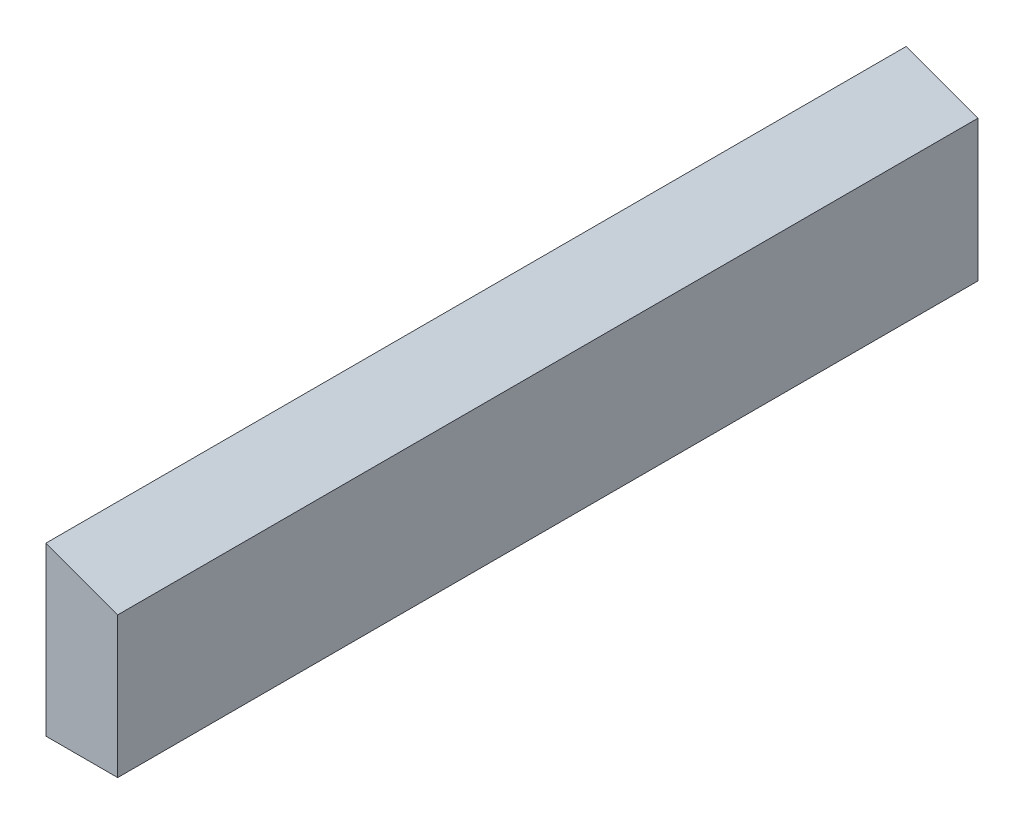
ISO-10303-21;
HEADER;
FILE_DESCRIPTION(('STEP AP214'),'2;1');
FILE_NAME('part.step','',(''),(''),'','','');
FILE_SCHEMA(('AUTOMOTIVE_DESIGN { 1 0 10303 214 1 1 1 1 }'));
ENDSEC;
DATA;
#1=APPLICATION_CONTEXT('core data for automotive mechanical design processes');
#2=APPLICATION_PROTOCOL_DEFINITION('international standard','automotive_design',2000,#1);
#3=PRODUCT_CONTEXT('',#1,'mechanical');
#4=PRODUCT('Part','Part','',(#3));
#5=PRODUCT_RELATED_PRODUCT_CATEGORY('part','',(#4));
#6=PRODUCT_DEFINITION_FORMATION('','',#4);
#7=PRODUCT_DEFINITION_CONTEXT('part definition',#1,'design');
#8=PRODUCT_DEFINITION('design','',#6,#7);
#9=PRODUCT_DEFINITION_SHAPE('','',#8);
#10=(LENGTH_UNIT() NAMED_UNIT(*) SI_UNIT(.MILLI.,.METRE.));
#11=(NAMED_UNIT(*) PLANE_ANGLE_UNIT() SI_UNIT($,.RADIAN.));
#12=(NAMED_UNIT(*) SI_UNIT($,.STERADIAN.) SOLID_ANGLE_UNIT());
#13=UNCERTAINTY_MEASURE_WITH_UNIT(LENGTH_MEASURE(1.E-05),#10,'distance_accuracy_value','');
#14=(GEOMETRIC_REPRESENTATION_CONTEXT(3) GLOBAL_UNCERTAINTY_ASSIGNED_CONTEXT((#13)) GLOBAL_UNIT_ASSIGNED_CONTEXT((#10,
#11,#12)) REPRESENTATION_CONTEXT('',''));
#15=CARTESIAN_POINT('',(0.,0.,0.));
#16=DIRECTION('',(0.,0.,1.));
#17=DIRECTION('',(1.,0.,0.));
#18=AXIS2_PLACEMENT_3D('',#15,#16,#17);
#19=CARTESIAN_POINT('',(-19.05,-44.45,-457.2));
#20=DIRECTION('',(1.,0.,0.));
#21=DIRECTION('',(0.,0.,-1.));
#22=AXIS2_PLACEMENT_3D('',#19,#20,#21);
#23=PLANE('',#22);
#24=DIRECTION('',(0.,1.,0.));
#25=VECTOR('',#24,1.);
#26=CARTESIAN_POINT('',(-19.05,-44.45,0.));
#27=LINE('',#26,#25);
#28=CARTESIAN_POINT('',(-19.05,-44.45,0.));
#29=VERTEX_POINT('',#28);
#30=CARTESIAN_POINT('',(-19.05,44.45,0.));
#31=VERTEX_POINT('',#30);
#32=EDGE_CURVE('E63',#29,#31,#27,.T.);
#33=ORIENTED_EDGE('',*,*,#32,.T.);
#34=DIRECTION('',(0.,0.,1.));
#35=VECTOR('',#34,1.);
#36=CARTESIAN_POINT('',(-19.05,44.45,-457.2));
#37=LINE('',#36,#35);
#38=CARTESIAN_POINT('',(-19.05,44.45,-457.2));
#39=VERTEX_POINT('',#38);
#40=EDGE_CURVE('E11',#39,#31,#37,.T.);
#41=ORIENTED_EDGE('',*,*,#40,.F.);
#42=DIRECTION('',(0.,1.,0.));
#43=VECTOR('',#42,1.);
#44=CARTESIAN_POINT('',(-19.05,-44.45,-457.2));
#45=LINE('',#44,#43);
#46=CARTESIAN_POINT('',(-19.05,-44.45,-457.2));
#47=VERTEX_POINT('',#46);
#48=EDGE_CURVE('E65',#47,#39,#45,.T.);
#49=ORIENTED_EDGE('',*,*,#48,.F.);
#50=DIRECTION('',(0.,0.,1.));
#51=VECTOR('',#50,1.);
#52=CARTESIAN_POINT('',(-19.05,-44.45,-457.2));
#53=LINE('',#52,#51);
#54=EDGE_CURVE('E48',#47,#29,#53,.T.);
#55=ORIENTED_EDGE('',*,*,#54,.T.);
#56=EDGE_LOOP('',(#33,#41,#49,#55));
#57=FACE_BOUND('',#56,.T.);
#58=ADVANCED_FACE('F32',(#57),#23,.F.);
#59=CARTESIAN_POINT('',(19.05,-44.45,-457.2));
#60=DIRECTION('',(1.,0.,0.));
#61=DIRECTION('',(0.,0.,-1.));
#62=AXIS2_PLACEMENT_3D('',#59,#60,#61);
#63=PLANE('',#62);
#64=DIRECTION('',(0.,0.,1.));
#65=VECTOR('',#64,1.);
#66=CARTESIAN_POINT('',(19.05,30.4508011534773,-457.2));
#67=LINE('',#66,#65);
#68=CARTESIAN_POINT('',(19.05,30.4508011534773,-457.2));
#69=VERTEX_POINT('',#68);
#70=CARTESIAN_POINT('',(19.05,30.4508011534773,0.));
#71=VERTEX_POINT('',#70);
#72=EDGE_CURVE('E78',#69,#71,#67,.T.);
#73=ORIENTED_EDGE('',*,*,#72,.T.);
#74=DIRECTION('',(0.,1.,0.));
#75=VECTOR('',#74,1.);
#76=CARTESIAN_POINT('',(19.05,-44.45,0.));
#77=LINE('',#76,#75);
#78=CARTESIAN_POINT('',(19.05,-44.45,0.));
#79=VERTEX_POINT('',#78);
#80=EDGE_CURVE('E77',#79,#71,#77,.T.);
#81=ORIENTED_EDGE('',*,*,#80,.F.);
#82=DIRECTION('',(0.,0.,1.));
#83=VECTOR('',#82,1.);
#84=CARTESIAN_POINT('',(19.05,-44.45,-457.2));
#85=LINE('',#84,#83);
#86=CARTESIAN_POINT('',(19.05,-44.45,-457.2));
#87=VERTEX_POINT('',#86);
#88=EDGE_CURVE('E40',#87,#79,#85,.T.);
#89=ORIENTED_EDGE('',*,*,#88,.F.);
#90=DIRECTION('',(0.,1.,0.));
#91=VECTOR('',#90,1.);
#92=CARTESIAN_POINT('',(19.05,-44.45,-457.2));
#93=LINE('',#92,#91);
#94=EDGE_CURVE('E82',#87,#69,#93,.T.);
#95=ORIENTED_EDGE('',*,*,#94,.T.);
#96=EDGE_LOOP('',(#73,#81,#89,#95));
#97=FACE_BOUND('',#96,.T.);
#98=ADVANCED_FACE('F103',(#97),#63,.T.);
#99=CARTESIAN_POINT('',(-19.05,-44.45,-457.2));
#100=DIRECTION('',(0.,-1.,0.));
#101=DIRECTION('',(0.,0.,-1.));
#102=AXIS2_PLACEMENT_3D('',#99,#100,#101);
#103=PLANE('',#102);
#104=DIRECTION('',(1.,0.,0.));
#105=VECTOR('',#104,1.);
#106=CARTESIAN_POINT('',(-19.05,-44.45,0.));
#107=LINE('',#106,#105);
#108=EDGE_CURVE('E74',#29,#79,#107,.T.);
#109=ORIENTED_EDGE('',*,*,#108,.F.);
#110=ORIENTED_EDGE('',*,*,#54,.F.);
#111=DIRECTION('',(1.,0.,0.));
#112=VECTOR('',#111,1.);
#113=CARTESIAN_POINT('',(-19.05,-44.45,-457.2));
#114=LINE('',#113,#112);
#115=EDGE_CURVE('E67',#47,#87,#114,.T.);
#116=ORIENTED_EDGE('',*,*,#115,.T.);
#117=ORIENTED_EDGE('',*,*,#88,.T.);
#118=EDGE_LOOP('',(#109,#110,#116,#117));
#119=FACE_BOUND('',#118,.T.);
#120=ADVANCED_FACE('F80',(#119),#103,.T.);
#121=CARTESIAN_POINT('',(0.,0.,-457.2));
#122=DIRECTION('',(0.,0.,-1.));
#123=DIRECTION('',(-1.,0.,0.));
#124=AXIS2_PLACEMENT_3D('',#121,#122,#123);
#125=PLANE('',#124);
#126=DIRECTION('',(0.938643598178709,-0.344888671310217,0.));
#127=VECTOR('',#126,1.);
#128=CARTESIAN_POINT('',(-19.05,44.45,-457.2));
#129=LINE('',#128,#127);
#130=EDGE_CURVE('E91',#39,#69,#129,.T.);
#131=ORIENTED_EDGE('',*,*,#130,.T.);
#132=ORIENTED_EDGE('',*,*,#94,.F.);
#133=ORIENTED_EDGE('',*,*,#115,.F.);
#134=ORIENTED_EDGE('',*,*,#48,.T.);
#135=EDGE_LOOP('',(#131,#132,#133,#134));
#136=FACE_BOUND('',#135,.T.);
#137=ADVANCED_FACE('F97',(#136),#125,.T.);
#138=CARTESIAN_POINT('',(0.,0.,0.));
#139=DIRECTION('',(0.,0.,-1.));
#140=DIRECTION('',(-1.,0.,0.));
#141=AXIS2_PLACEMENT_3D('',#138,#139,#140);
#142=PLANE('',#141);
#143=ORIENTED_EDGE('',*,*,#80,.T.);
#144=DIRECTION('',(0.938643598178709,-0.344888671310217,0.));
#145=VECTOR('',#144,1.);
#146=CARTESIAN_POINT('',(-19.05,44.45,0.));
#147=LINE('',#146,#145);
#148=EDGE_CURVE('E76',#31,#71,#147,.T.);
#149=ORIENTED_EDGE('',*,*,#148,.F.);
#150=ORIENTED_EDGE('',*,*,#32,.F.);
#151=ORIENTED_EDGE('',*,*,#108,.T.);
#152=EDGE_LOOP('',(#143,#149,#150,#151));
#153=FACE_BOUND('',#152,.T.);
#154=ADVANCED_FACE('F73',(#153),#142,.F.);
#155=CARTESIAN_POINT('',(-19.05,44.45,-457.2));
#156=DIRECTION('',(-0.344888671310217,-0.938643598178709,0.));
#157=DIRECTION('',(0.938643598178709,-0.344888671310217,0.));
#158=AXIS2_PLACEMENT_3D('',#155,#156,#157);
#159=PLANE('',#158);
#160=ORIENTED_EDGE('',*,*,#148,.T.);
#161=ORIENTED_EDGE('',*,*,#72,.F.);
#162=ORIENTED_EDGE('',*,*,#130,.F.);
#163=ORIENTED_EDGE('',*,*,#40,.T.);
#164=EDGE_LOOP('',(#160,#161,#162,#163));
#165=FACE_BOUND('',#164,.T.);
#166=ADVANCED_FACE('F106',(#165),#159,.F.);
#167=CLOSED_SHELL('',(#58,#98,#120,#137,#154,#166));
#168=MANIFOLD_SOLID_BREP('B2',#167);
#169=ADVANCED_BREP_SHAPE_REPRESENTATION('',(#18,#168),#14);
#170=SHAPE_DEFINITION_REPRESENTATION(#9,#169);
ENDSEC;
END-ISO-10303-21;
